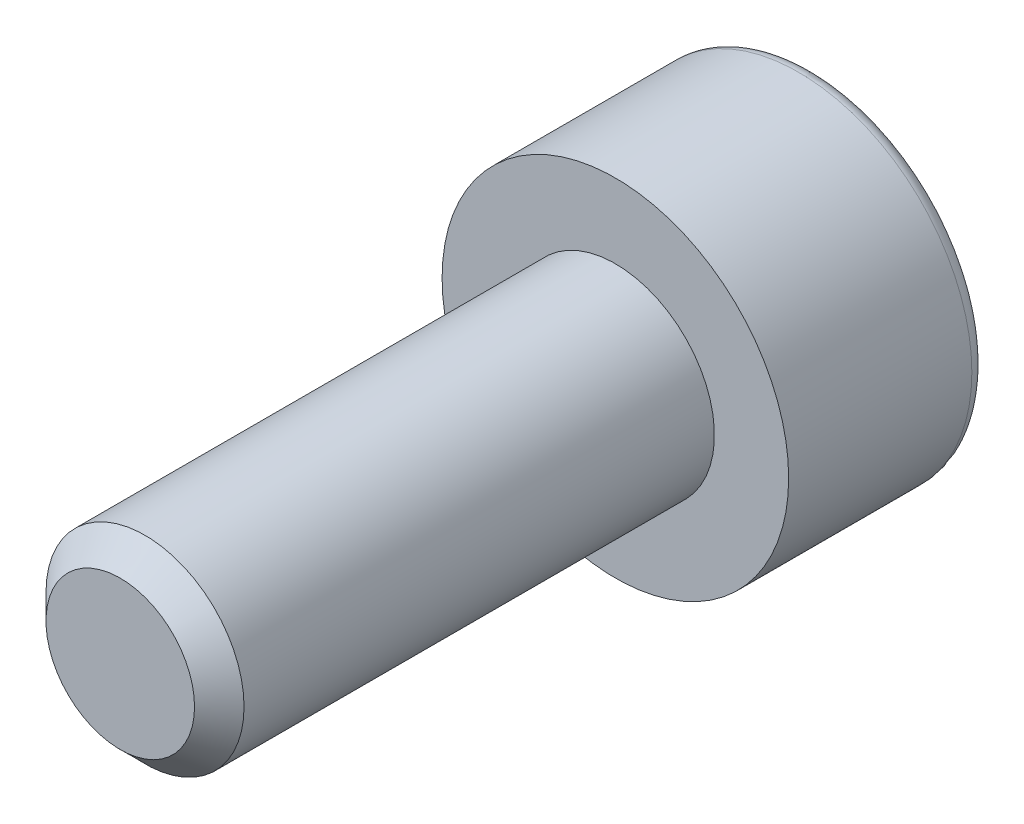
from build123d import *

# Parameters (mm, degrees)
ESQUISSE1_R             = 2
BASE_EXTRUSION_DEPTH    = 10
CHANFREIN1_SIZE         = 0.5
ESQUISSE2_R             = 3.5
BOSS_EXTRU_1_DEPTH      = 4
CONG_1_R                = 0.3
ENL_V_MAT_EXTRU_1_DEPTH = 4


with BuildPart() as part:
    # Esquisse1 → Base-Extrusion (new body)
    with BuildSketch(Plane.XY):
        Circle(ESQUISSE1_R)
    extrude(amount=BASE_EXTRUSION_DEPTH)

    # Chanfrein1
    chanfrein1_edges = [part.edges().sort_by_distance(p)[0] for p in [
        (-2, 0, 10),
    ]]
    chamfer(chanfrein1_edges, length=CHANFREIN1_SIZE)

    # Esquisse2 → Boss.-Extru.1 (add)
    with BuildSketch(Plane(origin=(0, 0, 0), x_dir=(-1, 0, 0), z_dir=(0, 0, -1))):
        Circle(ESQUISSE2_R)
    extrude(amount=BOSS_EXTRU_1_DEPTH)

    # Cong_1
    cong_1_edges = [part.edges().sort_by_distance(p)[0] for p in [
        (3.5, 0, -4),
    ]]
    fillet(cong_1_edges, radius=CONG_1_R)

    # Esquisse3 → Enl_v. mat.-Extru.1 (cut)
    with BuildSketch(Plane(origin=(0, 0, -4), x_dir=(-1, 0, 0), z_dir=(0, 0, -1))):
        Polygon((0, 1.732050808), (-1.5, 0.866025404), (-1.5, -0.866025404), (0, -1.732050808), (1.5, -0.866025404), (1.5, 0.866025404), align=None)
    extrude(amount=-ENL_V_MAT_EXTRU_1_DEPTH, mode=Mode.SUBTRACT)


solid = part.part
